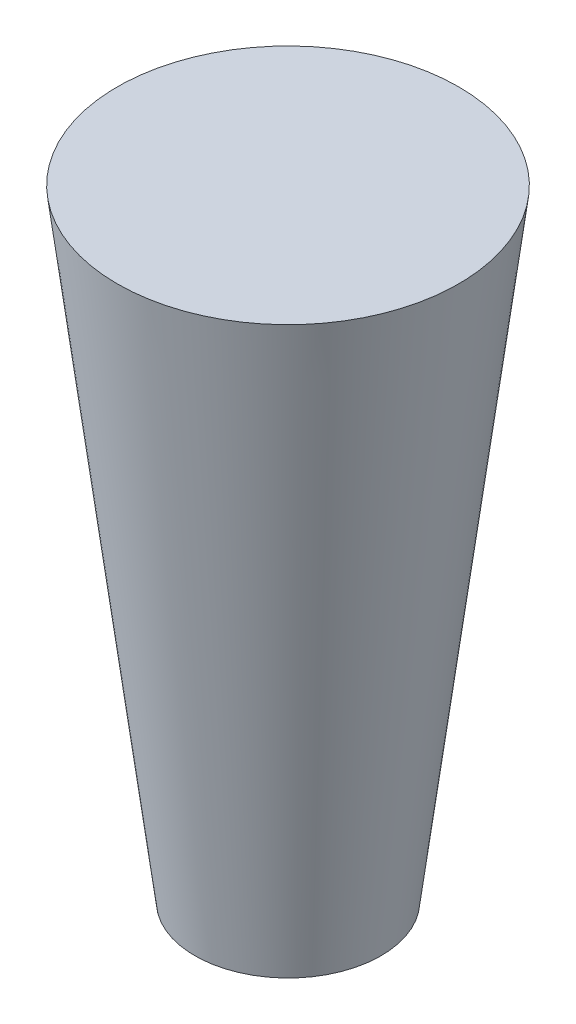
from build123d import *


with BuildPart() as part:
    # Sketch1 → Revolve1 (revolve)
    with BuildSketch(Plane.XY, mode=Mode.PRIVATE) as revolve1_sk:
        Polygon((0, 0), (-2.38125, 0), (-4.365625, 15.875), (0, 15.875), align=None)
    revolve(revolve1_sk.sketch.rotate(Axis((0, 0, 0), (0, 1, 0)), 270), axis=Axis((0, 0, 0), (0, 1, 0)))


solid = part.part
